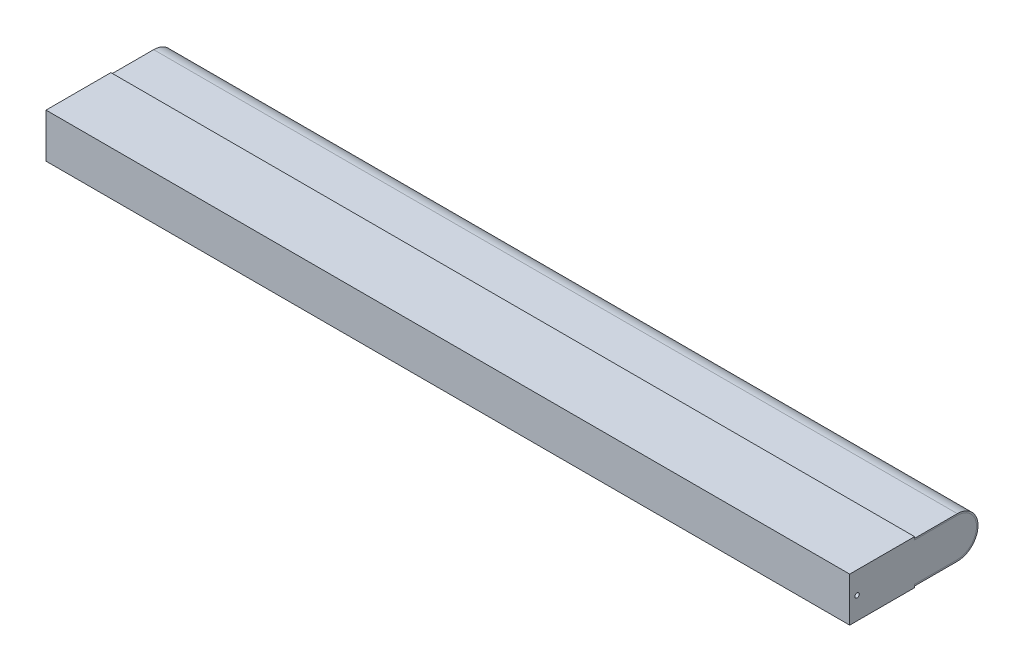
from build123d import *

# Parameters (mm, degrees)
SALIENTE_EXTRUIR1_DEPTH = 545
SALIENTE_EXTRUIR2_DEPTH = 545
CROQUIS5_R              = 1.5
CORTAR_EXTRUIR1_DEPTH   = 15


with BuildPart() as part:
    # Croquis1 → Saliente-Extruir1 (new body)
    with BuildSketch(Plane(origin=(0, 0, 0), x_dir=(0, 0, -1), z_dir=(1, 0, 0))):
        with BuildLine():
            Line((0, 0), (0, 30))
            Line((0, 30), (44, 30))
            Line((44, 30), (44, 28))
            Line((44, 28), (73, 28))
            ThreePointArc((73, 28), (86, 15), (73, 2))
            Line((73, 2), (44, 2))
            Line((44, 2), (44, 0))
            Line((44, 0), (0, 0))
        make_face()
    extrude(amount=SALIENTE_EXTRUIR1_DEPTH)

    # Croquis5 → Cortar-Extruir1 (cut)
    with BuildSketch(Plane.ZY):
        with Locations((-5, 15)):
            Circle(CROQUIS5_R)
    cortar_extruir1 = extrude(amount=-CORTAR_EXTRUIR1_DEPTH, mode=Mode.SUBTRACT)

    # Simetr_a1: Cortar-Extruir1 across plane
    add(cortar_extruir1.mirror(Plane.ZY.offset(-272.5)), mode=Mode.SUBTRACT)


with BuildPart() as body_2:
    # Croquis2 → Saliente-Extruir2 (new body)
    with BuildSketch(Plane.ZY):
        with BuildLine():
            Line((-44, 1), (-44, 2))
            Line((-44, 2), (-73, 2))
            ThreePointArc((-73, 2), (-86, 15), (-73, 28))
            Line((-73, 28), (-44, 28))
            Line((-44, 28), (-44, 29))
            Line((-44, 29), (-73, 29))
            ThreePointArc((-73, 29), (-87, 15), (-73, 1))
            Line((-73, 1), (-44, 1))
        make_face()
    extrude(amount=-SALIENTE_EXTRUIR2_DEPTH)


solid = Compound([part.part, body_2.part])
